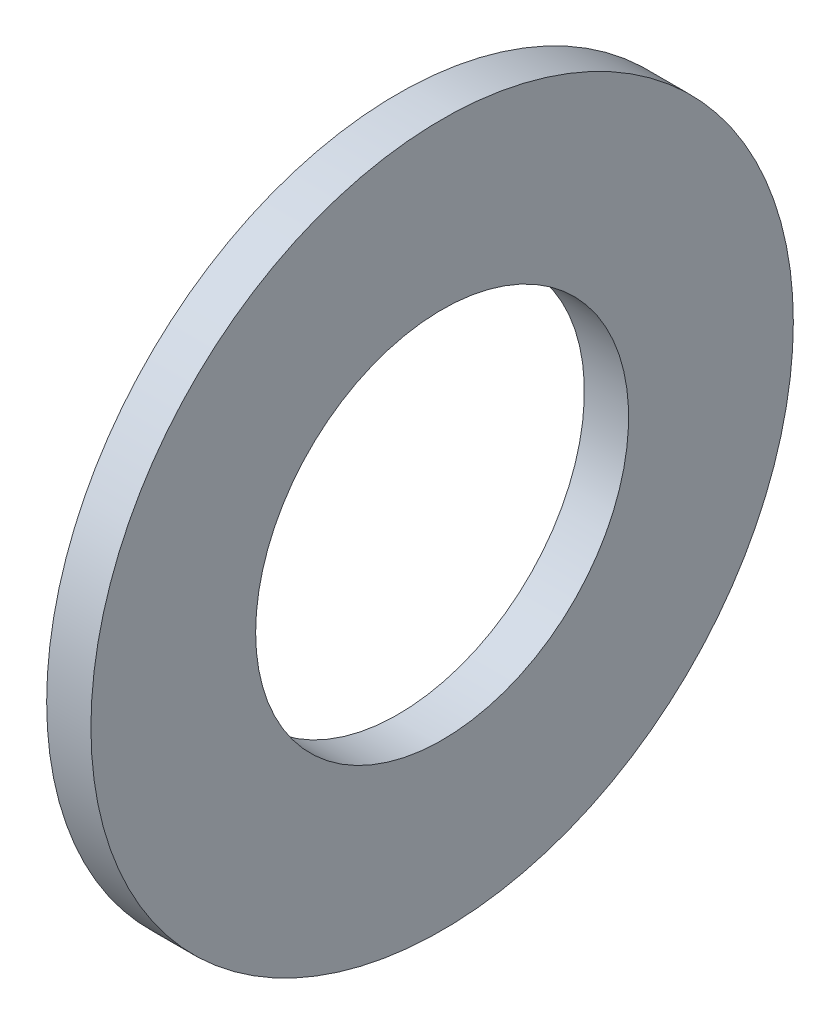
ISO-10303-21;
HEADER;
FILE_DESCRIPTION(('STEP AP214'),'2;1');
FILE_NAME('part.step','',(''),(''),'','','');
FILE_SCHEMA(('AUTOMOTIVE_DESIGN { 1 0 10303 214 1 1 1 1 }'));
ENDSEC;
DATA;
#1=APPLICATION_CONTEXT('core data for automotive mechanical design processes');
#2=APPLICATION_PROTOCOL_DEFINITION('international standard','automotive_design',2000,#1);
#3=PRODUCT_CONTEXT('',#1,'mechanical');
#4=PRODUCT('Part','Part','',(#3));
#5=PRODUCT_RELATED_PRODUCT_CATEGORY('part','',(#4));
#6=PRODUCT_DEFINITION_FORMATION('','',#4);
#7=PRODUCT_DEFINITION_CONTEXT('part definition',#1,'design');
#8=PRODUCT_DEFINITION('design','',#6,#7);
#9=PRODUCT_DEFINITION_SHAPE('','',#8);
#10=(LENGTH_UNIT() NAMED_UNIT(*) SI_UNIT(.MILLI.,.METRE.));
#11=(NAMED_UNIT(*) PLANE_ANGLE_UNIT() SI_UNIT($,.RADIAN.));
#12=(NAMED_UNIT(*) SI_UNIT($,.STERADIAN.) SOLID_ANGLE_UNIT());
#13=UNCERTAINTY_MEASURE_WITH_UNIT(LENGTH_MEASURE(1.E-05),#10,'distance_accuracy_value','');
#14=(GEOMETRIC_REPRESENTATION_CONTEXT(3) GLOBAL_UNCERTAINTY_ASSIGNED_CONTEXT((#13)) GLOBAL_UNIT_ASSIGNED_CONTEXT((#10,
#11,#12)) REPRESENTATION_CONTEXT('',''));
#15=CARTESIAN_POINT('',(0.,0.,0.));
#16=DIRECTION('',(0.,0.,1.));
#17=DIRECTION('',(1.,0.,0.));
#18=AXIS2_PLACEMENT_3D('',#15,#16,#17);
#19=CARTESIAN_POINT('',(-34.9249999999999,0.,0.));
#20=DIRECTION('',(-1.,0.,0.));
#21=DIRECTION('',(0.,0.,1.));
#22=AXIS2_PLACEMENT_3D('',#19,#20,#21);
#23=CYLINDRICAL_SURFACE('',#22,6.7437);
#24=CARTESIAN_POINT('',(0.,0.,0.));
#25=DIRECTION('',(-1.,0.,0.));
#26=DIRECTION('',(0.,0.,1.));
#27=AXIS2_PLACEMENT_3D('',#24,#25,#26);
#28=CIRCLE('',#27,6.7437);
#29=CARTESIAN_POINT('',(0.,0.,6.7437));
#30=VERTEX_POINT('',#29);
#31=EDGE_CURVE('E10',#30,#30,#28,.T.);
#32=ORIENTED_EDGE('',*,*,#31,.F.);
#33=EDGE_LOOP('',(#32));
#34=FACE_BOUND('',#33,.T.);
#35=CARTESIAN_POINT('',(-1.6002,0.,0.));
#36=DIRECTION('',(-1.,0.,0.));
#37=DIRECTION('',(0.,0.,1.));
#38=AXIS2_PLACEMENT_3D('',#35,#36,#37);
#39=CIRCLE('',#38,6.7437);
#40=CARTESIAN_POINT('',(-1.6002,0.,6.7437));
#41=VERTEX_POINT('',#40);
#42=EDGE_CURVE('E42',#41,#41,#39,.T.);
#43=ORIENTED_EDGE('',*,*,#42,.T.);
#44=EDGE_LOOP('',(#43));
#45=FACE_BOUND('',#44,.T.);
#46=ADVANCED_FACE('F28',(#34,#45),#23,.F.);
#47=CARTESIAN_POINT('',(0.,6.7437,0.));
#48=DIRECTION('',(-1.,0.,0.));
#49=DIRECTION('',(0.,0.,1.));
#50=AXIS2_PLACEMENT_3D('',#47,#48,#49);
#51=PLANE('',#50);
#52=CARTESIAN_POINT('',(0.,0.,0.));
#53=DIRECTION('',(-1.,0.,0.));
#54=DIRECTION('',(0.,0.,1.));
#55=AXIS2_PLACEMENT_3D('',#52,#53,#54);
#56=CIRCLE('',#55,12.7);
#57=CARTESIAN_POINT('',(0.,0.,12.7));
#58=VERTEX_POINT('',#57);
#59=EDGE_CURVE('E34',#58,#58,#56,.T.);
#60=ORIENTED_EDGE('',*,*,#59,.F.);
#61=EDGE_LOOP('',(#60));
#62=FACE_BOUND('',#61,.T.);
#63=ORIENTED_EDGE('',*,*,#31,.T.);
#64=EDGE_LOOP('',(#63));
#65=FACE_BOUND('',#64,.T.);
#66=ADVANCED_FACE('F57',(#62,#65),#51,.F.);
#67=CARTESIAN_POINT('',(-34.9249999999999,0.,0.));
#68=DIRECTION('',(-1.,0.,0.));
#69=DIRECTION('',(0.,0.,1.));
#70=AXIS2_PLACEMENT_3D('',#67,#68,#69);
#71=CYLINDRICAL_SURFACE('',#70,12.7);
#72=CARTESIAN_POINT('',(-1.6002,0.,0.));
#73=DIRECTION('',(-1.,0.,0.));
#74=DIRECTION('',(0.,0.,1.));
#75=AXIS2_PLACEMENT_3D('',#72,#73,#74);
#76=CIRCLE('',#75,12.7);
#77=CARTESIAN_POINT('',(-1.6002,0.,12.7));
#78=VERTEX_POINT('',#77);
#79=EDGE_CURVE('E38',#78,#78,#76,.T.);
#80=ORIENTED_EDGE('',*,*,#79,.F.);
#81=EDGE_LOOP('',(#80));
#82=FACE_BOUND('',#81,.T.);
#83=ORIENTED_EDGE('',*,*,#59,.T.);
#84=EDGE_LOOP('',(#83));
#85=FACE_BOUND('',#84,.T.);
#86=ADVANCED_FACE('F52',(#82,#85),#71,.T.);
#87=CARTESIAN_POINT('',(-1.6002,12.7,0.));
#88=DIRECTION('',(1.,0.,0.));
#89=DIRECTION('',(0.,0.,-1.));
#90=AXIS2_PLACEMENT_3D('',#87,#88,#89);
#91=PLANE('',#90);
#92=ORIENTED_EDGE('',*,*,#42,.F.);
#93=EDGE_LOOP('',(#92));
#94=FACE_BOUND('',#93,.T.);
#95=ORIENTED_EDGE('',*,*,#79,.T.);
#96=EDGE_LOOP('',(#95));
#97=FACE_BOUND('',#96,.T.);
#98=ADVANCED_FACE('F49',(#94,#97),#91,.F.);
#99=CLOSED_SHELL('',(#46,#66,#86,#98));
#100=MANIFOLD_SOLID_BREP('B2',#99);
#101=ADVANCED_BREP_SHAPE_REPRESENTATION('',(#18,#100),#14);
#102=SHAPE_DEFINITION_REPRESENTATION(#9,#101);
ENDSEC;
END-ISO-10303-21;
